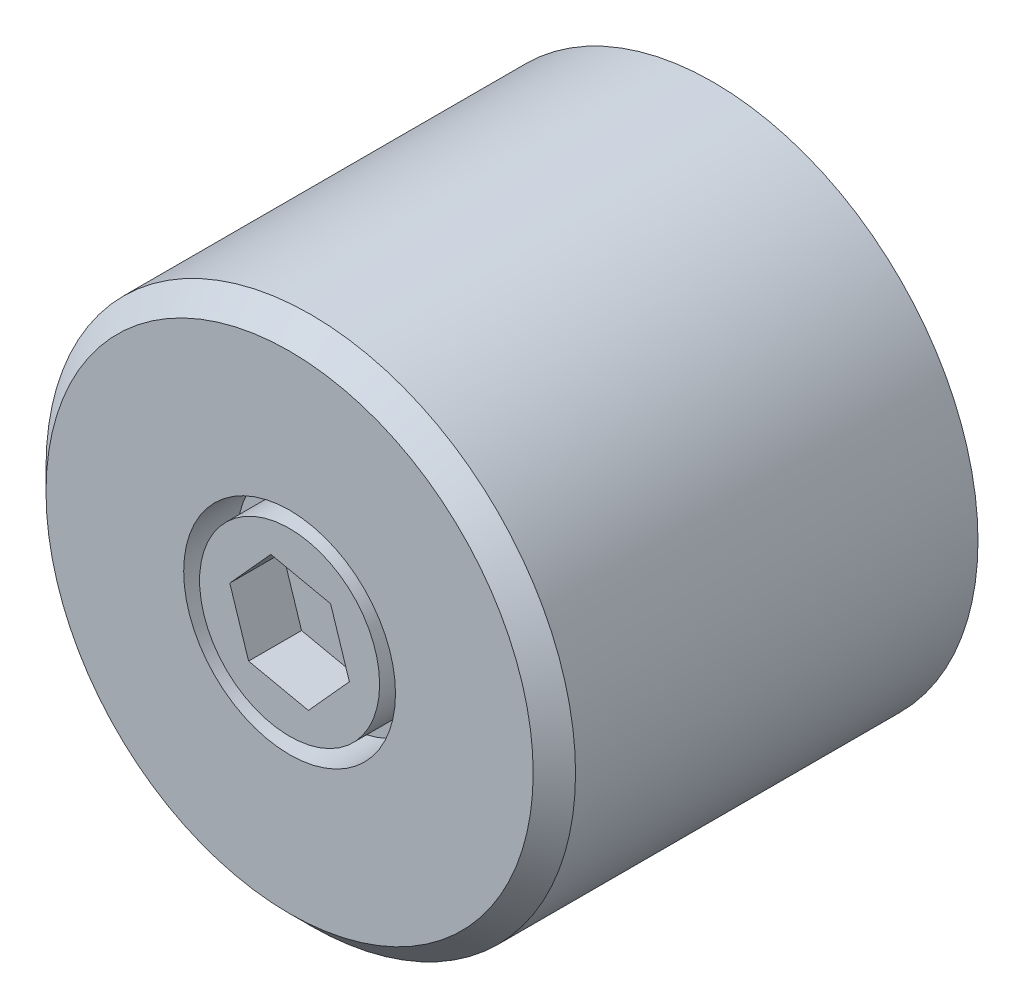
from build123d import *

# Parameters (mm, degrees)
SKICA1_R                 = 25
VYSUNOUT1_DEPTH          = 40
SKICA2_R                 = 10
SKICA2_R_2               = 8.5
ODEBRAT_VYSUNUT_M1_DEPTH = 5
ZKOSIT1_SIZE             = 2


with BuildPart() as part:
    # Skica1 → Vysunout1 (new body)
    with BuildSketch(Plane.XY):
        Circle(SKICA1_R)
    extrude(amount=VYSUNOUT1_DEPTH)

    # Skica2 → Odebrat vysunut_m1 (cut)
    # profile 1 of 2: a face of its own
    with BuildSketch(Plane.XY.offset(40)):
        Circle(SKICA2_R)
        Circle(SKICA2_R_2, mode=Mode.SUBTRACT)
    # profile 2 of 2: a face of its own
    with BuildSketch(Plane.XY.offset(40)):
        Polygon((3.872326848, 4.282337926), (-1.772450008, 5.494702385), (-5.644776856, 1.212364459), (-3.872326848, -4.282337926), (1.772450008, -5.494702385), (5.644776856, -1.212364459), align=None)
    extrude(amount=-ODEBRAT_VYSUNUT_M1_DEPTH, mode=Mode.SUBTRACT)

    # Zkosit1
    zkosit1_edges = [part.edges().sort_by_distance(p)[0] for p in [
        (-25, 0, 40),
    ]]
    chamfer(zkosit1_edges, length=ZKOSIT1_SIZE)


solid = part.part
